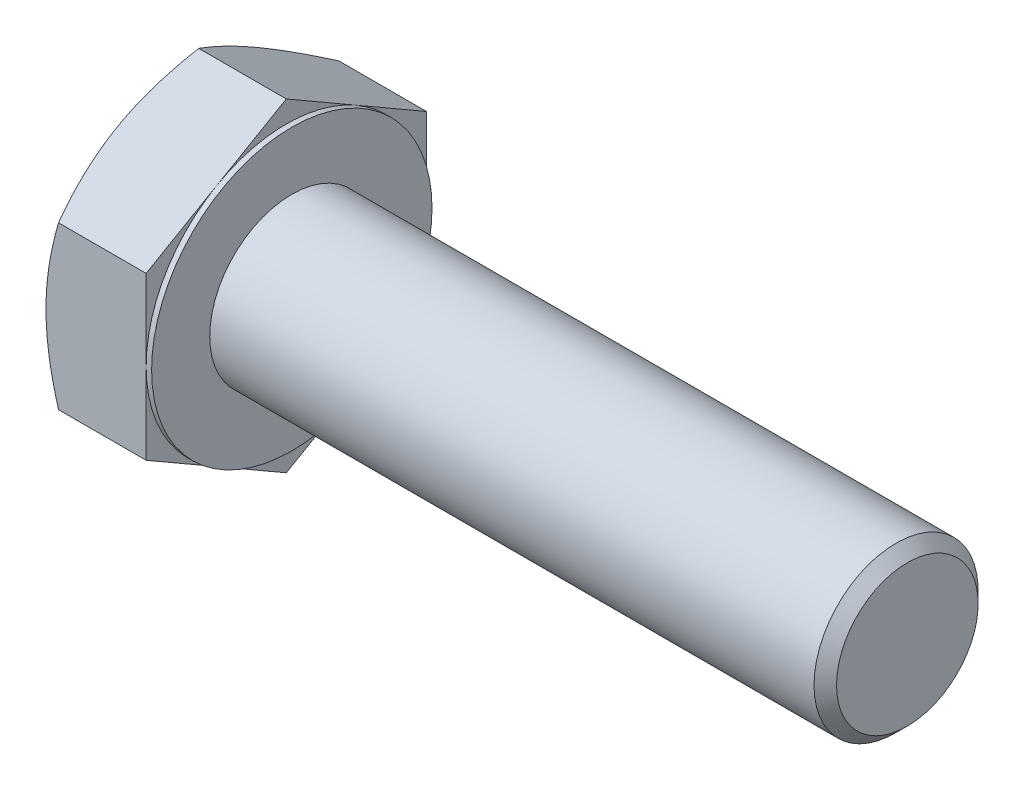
ISO-10303-21;
HEADER;
FILE_DESCRIPTION(('STEP AP214'),'2;1');
FILE_NAME('part.step','',(''),(''),'','','');
FILE_SCHEMA(('AUTOMOTIVE_DESIGN { 1 0 10303 214 1 1 1 1 }'));
ENDSEC;
DATA;
#1=APPLICATION_CONTEXT('core data for automotive mechanical design processes');
#2=APPLICATION_PROTOCOL_DEFINITION('international standard','automotive_design',2000,#1);
#3=PRODUCT_CONTEXT('',#1,'mechanical');
#4=PRODUCT('Part','Part','',(#3));
#5=PRODUCT_RELATED_PRODUCT_CATEGORY('part','',(#4));
#6=PRODUCT_DEFINITION_FORMATION('','',#4);
#7=PRODUCT_DEFINITION_CONTEXT('part definition',#1,'design');
#8=PRODUCT_DEFINITION('design','',#6,#7);
#9=PRODUCT_DEFINITION_SHAPE('','',#8);
#10=(LENGTH_UNIT() NAMED_UNIT(*) SI_UNIT(.MILLI.,.METRE.));
#11=(NAMED_UNIT(*) PLANE_ANGLE_UNIT() SI_UNIT($,.RADIAN.));
#12=(NAMED_UNIT(*) SI_UNIT($,.STERADIAN.) SOLID_ANGLE_UNIT());
#13=UNCERTAINTY_MEASURE_WITH_UNIT(LENGTH_MEASURE(1.E-05),#10,'distance_accuracy_value','');
#14=(GEOMETRIC_REPRESENTATION_CONTEXT(3) GLOBAL_UNCERTAINTY_ASSIGNED_CONTEXT((#13)) GLOBAL_UNIT_ASSIGNED_CONTEXT((#10,
#11,#12)) REPRESENTATION_CONTEXT('',''));
#15=CARTESIAN_POINT('',(0.,0.,0.));
#16=DIRECTION('',(0.,0.,1.));
#17=DIRECTION('',(1.,0.,0.));
#18=AXIS2_PLACEMENT_3D('',#15,#16,#17);
#19=CARTESIAN_POINT('',(15.44,23.6713610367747,0.));
#20=DIRECTION('',(1.,0.,0.));
#21=DIRECTION('',(0.,0.,-1.));
#22=AXIS2_PLACEMENT_3D('',#19,#20,#21);
#23=PLANE('',#22);
#24=CARTESIAN_POINT('',(15.44,0.,0.));
#25=DIRECTION('',(1.,0.,0.));
#26=DIRECTION('',(0.,0.,-1.));
#27=AXIS2_PLACEMENT_3D('',#24,#25,#26);
#28=CIRCLE('',#27,12.);
#29=CARTESIAN_POINT('',(15.44,0.,-12.));
#30=VERTEX_POINT('',#29);
#31=EDGE_CURVE('E277',#30,#30,#28,.F.);
#32=ORIENTED_EDGE('',*,*,#31,.T.);
#33=EDGE_LOOP('',(#32));
#34=FACE_BOUND('',#33,.T.);
#35=CARTESIAN_POINT('',(15.44,0.,0.));
#36=DIRECTION('',(1.,0.,0.));
#37=DIRECTION('',(0.,0.,-1.));
#38=AXIS2_PLACEMENT_3D('',#35,#36,#37);
#39=CIRCLE('',#38,20.5);
#40=CARTESIAN_POINT('',(15.44,0.,-20.5));
#41=VERTEX_POINT('',#40);
#42=EDGE_CURVE('E296',#41,#41,#39,.T.);
#43=ORIENTED_EDGE('',*,*,#42,.T.);
#44=EDGE_LOOP('',(#43));
#45=FACE_BOUND('',#44,.T.);
#46=ADVANCED_FACE('F33',(#34,#45),#23,.T.);
#47=CARTESIAN_POINT('',(0.,0.,0.));
#48=DIRECTION('',(-1.,0.,0.));
#49=DIRECTION('',(0.,0.,1.));
#50=AXIS2_PLACEMENT_3D('',#47,#48,#49);
#51=CYLINDRICAL_SURFACE('',#50,12.);
#52=ORIENTED_EDGE('',*,*,#31,.F.);
#53=EDGE_LOOP('',(#52));
#54=FACE_BOUND('',#53,.T.);
#55=CARTESIAN_POINT('',(103.792,0.,0.));
#56=DIRECTION('',(-1.,0.,0.));
#57=DIRECTION('',(0.,0.,1.));
#58=AXIS2_PLACEMENT_3D('',#55,#56,#57);
#59=CIRCLE('',#58,12.);
#60=CARTESIAN_POINT('',(103.792,0.,12.));
#61=VERTEX_POINT('',#60);
#62=EDGE_CURVE('E274',#61,#61,#59,.T.);
#63=ORIENTED_EDGE('',*,*,#62,.T.);
#64=EDGE_LOOP('',(#63));
#65=FACE_BOUND('',#64,.T.);
#66=ADVANCED_FACE('F248',(#54,#65),#51,.T.);
#67=CARTESIAN_POINT('',(105.44,0.,0.));
#68=DIRECTION('',(-1.,0.,0.));
#69=DIRECTION('',(0.,0.,1.));
#70=AXIS2_PLACEMENT_3D('',#67,#68,#69);
#71=CONICAL_SURFACE('',#70,10.352,0.785398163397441);
#72=ORIENTED_EDGE('',*,*,#62,.F.);
#73=EDGE_LOOP('',(#72));
#74=FACE_BOUND('',#73,.T.);
#75=CARTESIAN_POINT('',(105.44,0.,0.));
#76=DIRECTION('',(-1.,0.,0.));
#77=DIRECTION('',(0.,0.,1.));
#78=AXIS2_PLACEMENT_3D('',#75,#76,#77);
#79=CIRCLE('',#78,10.352);
#80=CARTESIAN_POINT('',(105.44,0.,10.352));
#81=VERTEX_POINT('',#80);
#82=EDGE_CURVE('E272',#81,#81,#79,.T.);
#83=ORIENTED_EDGE('',*,*,#82,.T.);
#84=EDGE_LOOP('',(#83));
#85=FACE_BOUND('',#84,.T.);
#86=ADVANCED_FACE('F253',(#74,#85),#71,.T.);
#87=CARTESIAN_POINT('',(105.44,0.,0.));
#88=DIRECTION('',(-1.,0.,0.));
#89=DIRECTION('',(0.,0.,1.));
#90=AXIS2_PLACEMENT_3D('',#87,#88,#89);
#91=PLANE('',#90);
#92=ORIENTED_EDGE('',*,*,#82,.F.);
#93=EDGE_LOOP('',(#92));
#94=FACE_BOUND('',#93,.T.);
#95=ADVANCED_FACE('F260',(#94),#91,.F.);
#96=CARTESIAN_POINT('',(14.64,20.5,0.));
#97=DIRECTION('',(1.,0.,0.));
#98=DIRECTION('',(0.,0.,-1.));
#99=AXIS2_PLACEMENT_3D('',#96,#97,#98);
#100=PLANE('',#99);
#101=DIRECTION('',(0.,0.500000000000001,0.866025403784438));
#102=VECTOR('',#101,1.);
#103=CARTESIAN_POINT('',(14.64,11.8356805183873,-20.5));
#104=LINE('',#103,#102);
#105=CARTESIAN_POINT('',(14.64,11.8356805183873,-20.5));
#106=VERTEX_POINT('',#105);
#107=CARTESIAN_POINT('',(14.64,17.753520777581,-10.25));
#108=VERTEX_POINT('',#107);
#109=EDGE_CURVE('E166',#106,#108,#104,.T.);
#110=ORIENTED_EDGE('',*,*,#109,.T.);
#111=CARTESIAN_POINT('',(14.64,0.,0.));
#112=DIRECTION('',(-1.,0.,0.));
#113=DIRECTION('',(0.,0.,1.));
#114=AXIS2_PLACEMENT_3D('',#111,#112,#113);
#115=CIRCLE('',#114,20.5);
#116=CARTESIAN_POINT('',(14.64,0.,-20.5));
#117=VERTEX_POINT('',#116);
#118=EDGE_CURVE('E49',#108,#117,#115,.T.);
#119=ORIENTED_EDGE('',*,*,#118,.T.);
#120=DIRECTION('',(0.,1.,0.));
#121=VECTOR('',#120,1.);
#122=CARTESIAN_POINT('',(14.64,11.8356805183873,-20.5));
#123=LINE('',#122,#121);
#124=EDGE_CURVE('E38',#117,#106,#123,.T.);
#125=ORIENTED_EDGE('',*,*,#124,.T.);
#126=EDGE_LOOP('',(#110,#119,#125));
#127=FACE_BOUND('',#126,.T.);
#128=ADVANCED_FACE('F263',(#127),#100,.T.);
#129=CARTESIAN_POINT('',(14.64,23.6713610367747,0.));
#130=VERTEX_POINT('',#129);
#131=EDGE_CURVE('E164',#108,#130,#104,.T.);
#132=ORIENTED_EDGE('',*,*,#131,.T.);
#133=DIRECTION('',(0.,-0.500000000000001,0.866025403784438));
#134=VECTOR('',#133,1.);
#135=CARTESIAN_POINT('',(14.64,23.6713610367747,0.));
#136=LINE('',#135,#134);
#137=CARTESIAN_POINT('',(14.64,17.753520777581,10.25));
#138=VERTEX_POINT('',#137);
#139=EDGE_CURVE('E163',#130,#138,#136,.T.);
#140=ORIENTED_EDGE('',*,*,#139,.T.);
#141=EDGE_CURVE('E152',#138,#108,#115,.T.);
#142=ORIENTED_EDGE('',*,*,#141,.T.);
#143=EDGE_LOOP('',(#132,#140,#142));
#144=FACE_BOUND('',#143,.T.);
#145=ADVANCED_FACE('F268',(#144),#100,.T.);
#146=CARTESIAN_POINT('',(14.64,11.8356805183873,20.5));
#147=VERTEX_POINT('',#146);
#148=EDGE_CURVE('E131',#138,#147,#136,.T.);
#149=ORIENTED_EDGE('',*,*,#148,.T.);
#150=DIRECTION('',(0.,-1.,0.));
#151=VECTOR('',#150,1.);
#152=CARTESIAN_POINT('',(14.64,11.8356805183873,20.5));
#153=LINE('',#152,#151);
#154=CARTESIAN_POINT('',(14.64,0.,20.5));
#155=VERTEX_POINT('',#154);
#156=EDGE_CURVE('E125',#147,#155,#153,.T.);
#157=ORIENTED_EDGE('',*,*,#156,.T.);
#158=EDGE_CURVE('E129',#155,#138,#115,.T.);
#159=ORIENTED_EDGE('',*,*,#158,.T.);
#160=EDGE_LOOP('',(#149,#157,#159));
#161=FACE_BOUND('',#160,.T.);
#162=ADVANCED_FACE('F127',(#161),#100,.T.);
#163=CARTESIAN_POINT('',(14.64,-11.8356805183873,20.5));
#164=VERTEX_POINT('',#163);
#165=EDGE_CURVE('E135',#155,#164,#153,.T.);
#166=ORIENTED_EDGE('',*,*,#165,.T.);
#167=DIRECTION('',(0.,-0.500000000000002,-0.866025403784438));
#168=VECTOR('',#167,1.);
#169=CARTESIAN_POINT('',(14.64,-23.6713610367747,0.));
#170=LINE('',#169,#168);
#171=CARTESIAN_POINT('',(14.64,-17.753520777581,10.25));
#172=VERTEX_POINT('',#171);
#173=EDGE_CURVE('E142',#164,#172,#170,.T.);
#174=ORIENTED_EDGE('',*,*,#173,.T.);
#175=EDGE_CURVE('E139',#172,#155,#115,.T.);
#176=ORIENTED_EDGE('',*,*,#175,.T.);
#177=EDGE_LOOP('',(#166,#174,#176));
#178=FACE_BOUND('',#177,.T.);
#179=ADVANCED_FACE('F140',(#178),#100,.T.);
#180=CARTESIAN_POINT('',(14.64,-23.6713610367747,0.));
#181=VERTEX_POINT('',#180);
#182=EDGE_CURVE('E158',#172,#181,#170,.T.);
#183=ORIENTED_EDGE('',*,*,#182,.T.);
#184=DIRECTION('',(0.,0.5,-0.866025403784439));
#185=VECTOR('',#184,1.);
#186=CARTESIAN_POINT('',(14.64,-11.8356805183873,-20.5));
#187=LINE('',#186,#185);
#188=CARTESIAN_POINT('',(14.64,-17.753520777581,-10.25));
#189=VERTEX_POINT('',#188);
#190=EDGE_CURVE('E332',#181,#189,#187,.T.);
#191=ORIENTED_EDGE('',*,*,#190,.T.);
#192=EDGE_CURVE('E146',#189,#172,#115,.T.);
#193=ORIENTED_EDGE('',*,*,#192,.T.);
#194=EDGE_LOOP('',(#183,#191,#193));
#195=FACE_BOUND('',#194,.T.);
#196=ADVANCED_FACE('F337',(#195),#100,.T.);
#197=CARTESIAN_POINT('',(14.64,-11.8356805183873,-20.5));
#198=VERTEX_POINT('',#197);
#199=EDGE_CURVE('E153',#189,#198,#187,.T.);
#200=ORIENTED_EDGE('',*,*,#199,.T.);
#201=EDGE_CURVE('E11',#198,#117,#123,.T.);
#202=ORIENTED_EDGE('',*,*,#201,.T.);
#203=EDGE_CURVE('E350',#117,#189,#115,.T.);
#204=ORIENTED_EDGE('',*,*,#203,.T.);
#205=EDGE_LOOP('',(#200,#202,#204));
#206=FACE_BOUND('',#205,.T.);
#207=ADVANCED_FACE('F269',(#206),#100,.T.);
#208=CARTESIAN_POINT('',(0.,0.,0.));
#209=DIRECTION('',(-1.,0.,0.));
#210=DIRECTION('',(0.,0.,1.));
#211=AXIS2_PLACEMENT_3D('',#208,#209,#210);
#212=CYLINDRICAL_SURFACE('',#211,20.5);
#213=ORIENTED_EDGE('',*,*,#118,.F.);
#214=ORIENTED_EDGE('',*,*,#141,.F.);
#215=ORIENTED_EDGE('',*,*,#158,.F.);
#216=ORIENTED_EDGE('',*,*,#175,.F.);
#217=ORIENTED_EDGE('',*,*,#192,.F.);
#218=ORIENTED_EDGE('',*,*,#203,.F.);
#219=EDGE_LOOP('',(#213,#214,#215,#216,#217,#218));
#220=FACE_BOUND('',#219,.T.);
#221=ORIENTED_EDGE('',*,*,#42,.F.);
#222=EDGE_LOOP('',(#221));
#223=FACE_BOUND('',#222,.T.);
#224=ADVANCED_FACE('F149',(#220,#223),#212,.T.);
#225=CARTESIAN_POINT('',(0.,23.6713610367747,0.));
#226=DIRECTION('',(1.,0.,0.));
#227=DIRECTION('',(0.,0.,-1.));
#228=AXIS2_PLACEMENT_3D('',#225,#226,#227);
#229=PLANE('',#228);
#230=CARTESIAN_POINT('',(0.,0.,0.));
#231=DIRECTION('',(1.,0.,0.));
#232=DIRECTION('',(0.,0.,-1.));
#233=AXIS2_PLACEMENT_3D('',#230,#231,#232);
#234=CIRCLE('',#233,20.5);
#235=CARTESIAN_POINT('',(0.,0.,-20.5));
#236=VERTEX_POINT('',#235);
#237=CARTESIAN_POINT('',(0.,17.753520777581,-10.25));
#238=VERTEX_POINT('',#237);
#239=EDGE_CURVE('E295',#236,#238,#234,.T.);
#240=ORIENTED_EDGE('',*,*,#239,.F.);
#241=CARTESIAN_POINT('',(0.,-17.753520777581,-10.25));
#242=VERTEX_POINT('',#241);
#243=EDGE_CURVE('E292',#242,#236,#234,.T.);
#244=ORIENTED_EDGE('',*,*,#243,.F.);
#245=CARTESIAN_POINT('',(0.,-17.753520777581,10.25));
#246=VERTEX_POINT('',#245);
#247=EDGE_CURVE('E294',#246,#242,#234,.T.);
#248=ORIENTED_EDGE('',*,*,#247,.F.);
#249=CARTESIAN_POINT('',(0.,0.,20.5));
#250=VERTEX_POINT('',#249);
#251=EDGE_CURVE('E304',#250,#246,#234,.T.);
#252=ORIENTED_EDGE('',*,*,#251,.F.);
#253=CARTESIAN_POINT('',(0.,0.,0.));
#254=DIRECTION('',(-1.,0.,0.));
#255=DIRECTION('',(0.,0.,1.));
#256=AXIS2_PLACEMENT_3D('',#253,#254,#255);
#257=CIRCLE('',#256,20.5);
#258=CARTESIAN_POINT('',(0.,17.753520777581,10.25));
#259=VERTEX_POINT('',#258);
#260=EDGE_CURVE('E167',#250,#259,#257,.T.);
#261=ORIENTED_EDGE('',*,*,#260,.T.);
#262=EDGE_CURVE('E299',#238,#259,#234,.T.);
#263=ORIENTED_EDGE('',*,*,#262,.F.);
#264=EDGE_LOOP('',(#240,#244,#248,#252,#261,#263));
#265=FACE_BOUND('',#264,.T.);
#266=ADVANCED_FACE('F198',(#265),#229,.F.);
#267=CARTESIAN_POINT('',(0.,0.,0.));
#268=DIRECTION('',(1.,0.,0.));
#269=DIRECTION('',(0.,0.,-1.));
#270=AXIS2_PLACEMENT_3D('',#267,#268,#269);
#271=CONICAL_SURFACE('',#270,20.5,1.0471975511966);
#272=CARTESIAN_POINT('',(1.83105281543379,11.8355650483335,20.5002));
#273=CARTESIAN_POINT('',(1.68086967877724,12.0957082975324,20.0496186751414));
#274=CARTESIAN_POINT('',(1.5375016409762,12.3568662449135,19.5972798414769));
#275=CARTESIAN_POINT('',(1.26629011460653,12.8812763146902,18.688974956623));
#276=CARTESIAN_POINT('',(1.13845173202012,13.1445290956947,18.2330077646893));
#277=CARTESIAN_POINT('',(0.900017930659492,13.6736376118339,17.3165649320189));
#278=CARTESIAN_POINT('',(0.789463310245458,13.9394979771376,16.8560812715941));
#279=CARTESIAN_POINT('',(0.587971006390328,14.4730660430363,15.9319142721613));
#280=CARTESIAN_POINT('',(0.497032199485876,14.7407736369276,15.4682311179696));
#281=CARTESIAN_POINT('',(0.338639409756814,15.2711766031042,14.5495462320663));
#282=CARTESIAN_POINT('',(0.270661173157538,15.5338325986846,14.0946127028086));
#283=CARTESIAN_POINT('',(0.15667706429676,16.0603481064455,13.1826610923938));
#284=CARTESIAN_POINT('',(0.110671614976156,16.3242076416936,12.7256429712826));
#285=CARTESIAN_POINT('',(0.0417946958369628,16.8523699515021,11.8108390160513));
#286=CARTESIAN_POINT('',(0.0188957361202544,17.1166718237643,11.3530547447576));
#287=CARTESIAN_POINT('',(-0.0032757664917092,17.6455194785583,10.4370637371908));
#288=CARTESIAN_POINT('',(-0.00254903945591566,17.9100652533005,9.97885701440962));
#289=CARTESIAN_POINT('',(0.0208807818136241,18.4046387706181,9.1222305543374));
#290=CARTESIAN_POINT('',(0.0407268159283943,18.6347017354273,8.72374981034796));
#291=CARTESIAN_POINT('',(0.0979103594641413,19.094278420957,7.92773964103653));
#292=CARTESIAN_POINT('',(0.135247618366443,19.3237921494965,7.5302102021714));
#293=CARTESIAN_POINT('',(0.22676651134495,19.7821855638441,6.73624951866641));
#294=CARTESIAN_POINT('',(0.280963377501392,20.0110644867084,6.33981959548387));
#295=CARTESIAN_POINT('',(0.405242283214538,20.4677264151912,5.54885793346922));
#296=CARTESIAN_POINT('',(0.475324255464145,20.6955094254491,5.15432618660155));
#297=CARTESIAN_POINT('',(0.711196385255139,21.387010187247,3.95661173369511));
#298=CARTESIAN_POINT('',(0.900518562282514,21.8487632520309,3.15683196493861));
#299=CARTESIAN_POINT('',(1.22283076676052,22.5362934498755,1.96599473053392));
#300=CARTESIAN_POINT('',(1.3365403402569,22.7644232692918,1.57086229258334));
#301=CARTESIAN_POINT('',(1.57547119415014,23.2191049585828,0.783330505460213));
#302=CARTESIAN_POINT('',(1.70068922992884,23.4456572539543,0.390930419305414));
#303=CARTESIAN_POINT('',(1.83105281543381,23.6714765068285,-0.000199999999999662));
#304=B_SPLINE_CURVE_WITH_KNOTS('',3,(#272,#273,#274,#275,#276,#277,#278,#279,#280,#281,#282,
#283,#284,#285,#286,#287,#288,#289,#290,#291,#292,#293,#294,#295,#296,#297,#298,#299,#300,#301,
#302,#303),.UNSPECIFIED.,.F.,.F.,(4,2,2,2,2,2,2,2,2,2,2,2,2,2,2,4),(0.,1.62462772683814,
3.24978817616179,4.87872871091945,6.50757592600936,8.09621981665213,9.68489428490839,
11.2716764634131,12.8584096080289,14.2397371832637,15.6210449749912,17.0036043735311,
18.3861579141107,21.2121645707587,22.6227063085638,24.0328515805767),.UNSPECIFIED.);
#305=CARTESIAN_POINT('',(1.83098614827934,23.6713610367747,0.));
#306=VERTEX_POINT('',#305);
#307=EDGE_CURVE('E217',#259,#306,#304,.T.);
#308=ORIENTED_EDGE('',*,*,#307,.T.);
#309=CARTESIAN_POINT('',(1.83105281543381,23.6714765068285,0.000200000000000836));
#310=CARTESIAN_POINT('',(1.68086967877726,23.4113332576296,-0.45038132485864));
#311=CARTESIAN_POINT('',(1.53750164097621,23.1501753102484,-0.902720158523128));
#312=CARTESIAN_POINT('',(1.26629011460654,22.6257652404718,-1.81102504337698));
#313=CARTESIAN_POINT('',(1.13845173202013,22.3625124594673,-2.26699223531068));
#314=CARTESIAN_POINT('',(0.900017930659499,21.8334039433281,-3.1834350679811));
#315=CARTESIAN_POINT('',(0.789463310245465,21.5675435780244,-3.64391872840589));
#316=CARTESIAN_POINT('',(0.587971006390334,21.0339755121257,-4.56808572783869));
#317=CARTESIAN_POINT('',(0.497032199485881,20.7662679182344,-5.0317688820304));
#318=CARTESIAN_POINT('',(0.338639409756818,20.2358649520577,-5.95045376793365));
#319=CARTESIAN_POINT('',(0.270661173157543,19.9732089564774,-6.40538729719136));
#320=CARTESIAN_POINT('',(0.156677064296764,19.4466934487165,-7.3173389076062));
#321=CARTESIAN_POINT('',(0.110671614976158,19.1828339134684,-7.77435702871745));
#322=CARTESIAN_POINT('',(0.0417946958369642,18.6546716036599,-8.68916098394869));
#323=CARTESIAN_POINT('',(0.0188957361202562,18.3903697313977,-9.14694525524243));
#324=CARTESIAN_POINT('',(-0.0032757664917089,17.8615220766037,-10.0629362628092));
#325=CARTESIAN_POINT('',(-0.00254903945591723,17.5969763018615,-10.5211429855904));
#326=CARTESIAN_POINT('',(0.0208807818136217,17.1024027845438,-11.3777694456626));
#327=CARTESIAN_POINT('',(0.0407268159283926,16.8723398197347,-11.776250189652));
#328=CARTESIAN_POINT('',(0.0979103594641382,16.412763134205,-12.5722603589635));
#329=CARTESIAN_POINT('',(0.135247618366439,16.1832494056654,-12.9697897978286));
#330=CARTESIAN_POINT('',(0.226766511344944,15.7248559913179,-13.7637504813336));
#331=CARTESIAN_POINT('',(0.280963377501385,15.4959770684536,-14.1601804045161));
#332=CARTESIAN_POINT('',(0.40524228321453,15.0393151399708,-14.9511420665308));
#333=CARTESIAN_POINT('',(0.475324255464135,14.8115321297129,-15.3456738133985));
#334=CARTESIAN_POINT('',(0.711196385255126,14.120031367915,-16.5433882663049));
#335=CARTESIAN_POINT('',(0.900518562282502,13.658278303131,-17.3431680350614));
#336=CARTESIAN_POINT('',(1.22283076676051,12.9707481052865,-18.5340052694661));
#337=CARTESIAN_POINT('',(1.33654034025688,12.7426182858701,-18.9291377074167));
#338=CARTESIAN_POINT('',(1.57547119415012,12.2879365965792,-19.7166694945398));
#339=CARTESIAN_POINT('',(1.70068922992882,12.0613843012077,-20.1090695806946));
#340=CARTESIAN_POINT('',(1.83105281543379,11.8355650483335,-20.5002));
#341=B_SPLINE_CURVE_WITH_KNOTS('',3,(#309,#310,#311,#312,#313,#314,#315,#316,#317,#318,#319,
#320,#321,#322,#323,#324,#325,#326,#327,#328,#329,#330,#331,#332,#333,#334,#335,#336,#337,#338,
#339,#340),.UNSPECIFIED.,.F.,.F.,(4,2,2,2,2,2,2,2,2,2,2,2,2,2,2,4),(0.,1.62462772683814,
3.24978817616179,4.87872871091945,6.50757592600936,8.09621981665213,9.6848942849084,
11.2716764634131,12.8584096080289,14.2397371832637,15.6210449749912,17.0036043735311,
18.3861579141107,21.2121645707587,22.6227063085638,24.0328515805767),.UNSPECIFIED.);
#342=EDGE_CURVE('E57',#306,#238,#341,.T.);
#343=ORIENTED_EDGE('',*,*,#342,.T.);
#344=ORIENTED_EDGE('',*,*,#262,.T.);
#345=EDGE_LOOP('',(#308,#343,#344));
#346=FACE_BOUND('',#345,.T.);
#347=ADVANCED_FACE('F346',(#346),#271,.T.);
#348=CARTESIAN_POINT('',(10.0045735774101,-31.7921389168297,20.5));
#349=CARTESIAN_POINT('',(9.78736329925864,-31.3444790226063,20.5));
#350=CARTESIAN_POINT('',(9.57123614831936,-30.896293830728,20.5));
#351=CARTESIAN_POINT('',(9.14139340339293,-29.9987632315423,20.5));
#352=CARTESIAN_POINT('',(8.92767783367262,-29.5494178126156,20.5));
#353=CARTESIAN_POINT('',(8.29046013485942,-28.1993571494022,20.5));
#354=CARTESIAN_POINT('',(7.87095143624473,-27.2967499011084,20.5));
#355=CARTESIAN_POINT('',(7.04286118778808,-25.480583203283,20.5));
#356=CARTESIAN_POINT('',(6.63435156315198,-24.5669908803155,20.5));
#357=CARTESIAN_POINT('',(5.83404260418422,-22.7325410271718,20.5));
#358=CARTESIAN_POINT('',(5.44224248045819,-21.8116838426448,20.5));
#359=CARTESIAN_POINT('',(4.66751070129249,-19.9314771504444,20.5));
#360=CARTESIAN_POINT('',(4.28526901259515,-18.9718418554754,20.5));
#361=CARTESIAN_POINT('',(3.54971359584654,-17.0413372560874,20.5));
#362=CARTESIAN_POINT('',(3.19640311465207,-16.070466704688,20.5));
#363=CARTESIAN_POINT('',(2.52799067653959,-14.1177960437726,20.5));
#364=CARTESIAN_POINT('',(2.2128113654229,-13.1360226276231,20.5));
#365=CARTESIAN_POINT('',(1.63075735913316,-11.1582993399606,20.5));
#366=CARTESIAN_POINT('',(1.36386744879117,-10.1623540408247,20.5));
#367=CARTESIAN_POINT('',(1.01013936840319,-8.66039751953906,20.5));
#368=CARTESIAN_POINT('',(0.900235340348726,-8.15978559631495,20.5));
#369=CARTESIAN_POINT('',(0.697271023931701,-7.15514108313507,20.5));
#370=CARTESIAN_POINT('',(0.604210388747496,-6.65110856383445,20.5));
#371=CARTESIAN_POINT('',(0.436577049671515,-5.63997954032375,20.5));
#372=CARTESIAN_POINT('',(0.362003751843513,-5.13288313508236,20.5));
#373=CARTESIAN_POINT('',(0.23282804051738,-4.11613536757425,20.5));
#374=CARTESIAN_POINT('',(0.178225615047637,-3.60648400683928,20.5));
#375=CARTESIAN_POINT('',(0.090765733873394,-2.59202077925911,20.5));
#376=CARTESIAN_POINT('',(0.0576332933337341,-2.08723276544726,20.5));
#377=CARTESIAN_POINT('',(0.0127447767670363,-1.07670899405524,20.5));
#378=CARTESIAN_POINT('',(0.000988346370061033,-0.570973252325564,20.5));
#379=CARTESIAN_POINT('',(-0.000868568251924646,0.440543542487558,20.5));
#380=CARTESIAN_POINT('',(0.00903105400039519,0.946324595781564,20.5));
#381=CARTESIAN_POINT('',(0.0502449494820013,1.95701882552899,20.5));
#382=CARTESIAN_POINT('',(0.0815601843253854,2.46193196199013,20.5));
#383=CARTESIAN_POINT('',(0.18189293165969,3.67541240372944,20.5));
#384=CARTESIAN_POINT('',(0.261072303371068,4.38315427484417,20.5));
#385=CARTESIAN_POINT('',(0.457195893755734,5.79338947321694,20.5));
#386=CARTESIAN_POINT('',(0.574145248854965,6.49588207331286,20.5));
#387=CARTESIAN_POINT('',(0.841648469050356,7.89494840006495,20.5));
#388=CARTESIAN_POINT('',(0.992228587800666,8.59151705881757,20.5));
#389=CARTESIAN_POINT('',(1.32239799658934,9.97766865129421,20.5));
#390=CARTESIAN_POINT('',(1.50198684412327,10.6672516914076,20.5));
#391=CARTESIAN_POINT('',(1.89003635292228,12.0545545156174,20.5));
#392=CARTESIAN_POINT('',(2.09904485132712,12.7521199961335,20.5));
#393=CARTESIAN_POINT('',(2.538641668,14.1403793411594,20.5));
#394=CARTESIAN_POINT('',(2.76923012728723,14.8310731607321,20.5));
#395=CARTESIAN_POINT('',(3.2483270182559,16.2059303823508,20.5));
#396=CARTESIAN_POINT('',(3.49682946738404,16.8900958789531,20.5));
#397=CARTESIAN_POINT('',(4.00883234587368,18.2527591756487,20.5));
#398=CARTESIAN_POINT('',(4.27233260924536,18.9312570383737,20.5));
#399=CARTESIAN_POINT('',(4.90504075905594,20.5167699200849,20.5));
#400=CARTESIAN_POINT('',(5.27932054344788,21.421757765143,20.5));
#401=CARTESIAN_POINT('',(6.04577825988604,23.224144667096,20.5));
#402=CARTESIAN_POINT('',(6.43795725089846,24.1215432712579,20.5));
#403=CARTESIAN_POINT('',(7.23667478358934,25.9101426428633,20.5));
#404=CARTESIAN_POINT('',(7.64321640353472,26.8013420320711,20.5));
#405=CARTESIAN_POINT('',(8.46779917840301,28.5783696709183,20.5));
#406=CARTESIAN_POINT('',(8.88584009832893,29.4641980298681,20.5));
#407=CARTESIAN_POINT('',(9.73174717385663,31.2323047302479,20.5));
#408=CARTESIAN_POINT('',(10.1596233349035,32.1145782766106,20.5));
#409=CARTESIAN_POINT('',(11.023106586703,33.8753332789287,20.5));
#410=CARTESIAN_POINT('',(11.4587137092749,34.7538147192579,20.5));
#411=CARTESIAN_POINT('',(12.336294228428,36.5074549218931,20.5));
#412=CARTESIAN_POINT('',(12.7782668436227,37.3826140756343,20.5));
#413=CARTESIAN_POINT('',(13.6675972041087,39.1301871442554,20.5));
#414=CARTESIAN_POINT('',(14.1149549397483,40.002601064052,20.5));
#415=CARTESIAN_POINT('',(15.3896420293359,42.4725798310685,20.5));
#416=CARTESIAN_POINT('',(16.2223378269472,44.0673751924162,20.5));
#417=CARTESIAN_POINT('',(17.8991647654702,47.2509978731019,20.5));
#418=CARTESIAN_POINT('',(18.7432962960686,48.8398249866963,20.5));
#419=CARTESIAN_POINT('',(20.4382614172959,52.0089141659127,20.5));
#420=CARTESIAN_POINT('',(21.2890736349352,53.589187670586,20.5));
#421=CARTESIAN_POINT('',(22.5704014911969,55.9567745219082,20.5));
#422=CARTESIAN_POINT('',(22.9983509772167,56.7454787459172,20.5));
#423=CARTESIAN_POINT('',(23.8557834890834,58.3220516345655,20.5));
#424=CARTESIAN_POINT('',(24.2852665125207,59.1099203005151,20.5));
#425=CARTESIAN_POINT('',(24.7154284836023,59.8974182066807,20.5));
#426=B_SPLINE_CURVE_WITH_KNOTS('',3,(#348,#349,#350,#351,#352,#353,#354,#355,#356,#357,#358,
#359,#360,#361,#362,#363,#364,#365,#366,#367,#368,#369,#370,#371,#372,#373,#374,#375,#376,#377,
#378,#379,#380,#381,#382,#383,#384,#385,#386,#387,#388,#389,#390,#391,#392,#393,#394,#395,#396,
#397,#398,#399,#400,#401,#402,#403,#404,#405,#406,#407,#408,#409,#410,#411,#412,#413,#414,#415,
#416,#417,#418,#419,#420,#421,#422,#423,#424,#425),.UNSPECIFIED.,.F.,.F.,(4,2,2,2,2,2,2,2,2,2,2,
2,2,2,2,2,2,2,2,2,2,2,2,2,2,2,2,2,2,2,2,2,2,2,2,2,2,2,4),(0.,1.49271869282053,2.9854523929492,
5.97136149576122,8.9735268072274,11.9755501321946,15.0740772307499,18.1729515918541,
21.2654301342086,24.3569325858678,25.8942973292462,27.4316304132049,28.9689141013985,
30.5061968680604,32.0233793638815,33.5405367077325,35.0577015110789,36.5749344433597,
38.7102245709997,40.8458052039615,42.9830588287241,45.1202798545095,47.3044767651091,
49.4886879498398,51.6721730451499,53.8556339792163,56.7933660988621,59.7312722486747,
62.6698119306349,65.6082916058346,68.5499059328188,71.4915323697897,74.4328007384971,
77.3740638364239,82.771288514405,88.168697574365,93.5529397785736,96.2449184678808,
98.9368929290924),.UNSPECIFIED.);
#427=CARTESIAN_POINT('',(1.83098614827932,11.8356805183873,20.5));
#428=VERTEX_POINT('',#427);
#429=EDGE_CURVE('E231',#250,#428,#426,.T.);
#430=ORIENTED_EDGE('',*,*,#429,.T.);
#431=EDGE_CURVE('E230',#428,#259,#304,.T.);
#432=ORIENTED_EDGE('',*,*,#431,.T.);
#433=ORIENTED_EDGE('',*,*,#260,.F.);
#434=EDGE_LOOP('',(#430,#432,#433));
#435=FACE_BOUND('',#434,.T.);
#436=ADVANCED_FACE('F342',(#435),#271,.T.);
#437=CARTESIAN_POINT('',(1.83098614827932,-11.8356805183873,20.5));
#438=VERTEX_POINT('',#437);
#439=EDGE_CURVE('E275',#438,#250,#426,.T.);
#440=ORIENTED_EDGE('',*,*,#439,.T.);
#441=ORIENTED_EDGE('',*,*,#251,.T.);
#442=CARTESIAN_POINT('',(1.83105281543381,-23.6714765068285,-0.000200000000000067));
#443=CARTESIAN_POINT('',(1.68086967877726,-23.4113332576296,0.450381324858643));
#444=CARTESIAN_POINT('',(1.53750164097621,-23.1501753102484,0.90272015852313));
#445=CARTESIAN_POINT('',(1.26629011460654,-22.6257652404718,1.81102504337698));
#446=CARTESIAN_POINT('',(1.13845173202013,-22.3625124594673,2.26699223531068));
#447=CARTESIAN_POINT('',(0.900017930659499,-21.8334039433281,3.1834350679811));
#448=CARTESIAN_POINT('',(0.789463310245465,-21.5675435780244,3.64391872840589));
#449=CARTESIAN_POINT('',(0.587971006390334,-21.0339755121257,4.5680857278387));
#450=CARTESIAN_POINT('',(0.497032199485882,-20.7662679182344,5.03176888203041));
#451=CARTESIAN_POINT('',(0.338639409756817,-20.2358649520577,5.95045376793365));
#452=CARTESIAN_POINT('',(0.270661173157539,-19.9732089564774,6.40538729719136));
#453=CARTESIAN_POINT('',(0.15667706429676,-19.4466934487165,7.3173389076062));
#454=CARTESIAN_POINT('',(0.110671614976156,-19.1828339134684,7.77435702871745));
#455=CARTESIAN_POINT('',(0.0417946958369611,-18.6546716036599,8.68916098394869));
#456=CARTESIAN_POINT('',(0.0188957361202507,-18.3903697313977,9.14694525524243));
#457=CARTESIAN_POINT('',(-0.00327576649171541,-17.8615220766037,10.0629362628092));
#458=CARTESIAN_POINT('',(-0.00254903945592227,-17.5969763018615,10.5211429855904));
#459=CARTESIAN_POINT('',(0.0208807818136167,-17.1024027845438,11.3777694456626));
#460=CARTESIAN_POINT('',(0.0407268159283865,-16.8723398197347,11.776250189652));
#461=CARTESIAN_POINT('',(0.0979103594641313,-16.412763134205,12.5722603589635));
#462=CARTESIAN_POINT('',(0.135247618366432,-16.1832494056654,12.9697897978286));
#463=CARTESIAN_POINT('',(0.226766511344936,-15.7248559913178,13.7637504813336));
#464=CARTESIAN_POINT('',(0.280963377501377,-15.4959770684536,14.1601804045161));
#465=CARTESIAN_POINT('',(0.405242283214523,-15.0393151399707,14.9511420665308));
#466=CARTESIAN_POINT('',(0.47532425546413,-14.8115321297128,15.3456738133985));
#467=CARTESIAN_POINT('',(0.711196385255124,-14.120031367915,16.5433882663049));
#468=CARTESIAN_POINT('',(0.900518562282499,-13.658278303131,17.3431680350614));
#469=CARTESIAN_POINT('',(1.2228307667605,-12.9707481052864,18.5340052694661));
#470=CARTESIAN_POINT('',(1.33654034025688,-12.7426182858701,18.9291377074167));
#471=CARTESIAN_POINT('',(1.57547119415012,-12.2879365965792,19.7166694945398));
#472=CARTESIAN_POINT('',(1.70068922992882,-12.0613843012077,20.1090695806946));
#473=CARTESIAN_POINT('',(1.83105281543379,-11.8355650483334,20.5002));
#474=B_SPLINE_CURVE_WITH_KNOTS('',3,(#442,#443,#444,#445,#446,#447,#448,#449,#450,#451,#452,
#453,#454,#455,#456,#457,#458,#459,#460,#461,#462,#463,#464,#465,#466,#467,#468,#469,#470,#471,
#472,#473),.UNSPECIFIED.,.F.,.F.,(4,2,2,2,2,2,2,2,2,2,2,2,2,2,2,4),(0.,1.62462772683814,
3.24978817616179,4.87872871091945,6.50757592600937,8.09621981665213,9.6848942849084,
11.2716764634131,12.8584096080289,14.2397371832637,15.6210449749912,17.0036043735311,
18.3861579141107,21.2121645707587,22.6227063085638,24.0328515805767),.UNSPECIFIED.);
#475=EDGE_CURVE('E219',#246,#438,#474,.T.);
#476=ORIENTED_EDGE('',*,*,#475,.T.);
#477=EDGE_LOOP('',(#440,#441,#476));
#478=FACE_BOUND('',#477,.T.);
#479=ADVANCED_FACE('F187',(#478),#271,.T.);
#480=CARTESIAN_POINT('',(1.83098614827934,-23.6713610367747,0.));
#481=VERTEX_POINT('',#480);
#482=EDGE_CURVE('E211',#481,#246,#474,.T.);
#483=ORIENTED_EDGE('',*,*,#482,.T.);
#484=ORIENTED_EDGE('',*,*,#247,.T.);
#485=CARTESIAN_POINT('',(1.8310528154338,-11.8355650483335,-20.5002));
#486=CARTESIAN_POINT('',(1.68086967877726,-12.0957082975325,-20.0496186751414));
#487=CARTESIAN_POINT('',(1.53750164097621,-12.3568662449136,-19.5972798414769));
#488=CARTESIAN_POINT('',(1.26629011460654,-12.8812763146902,-18.688974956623));
#489=CARTESIAN_POINT('',(1.13845173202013,-13.1445290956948,-18.2330077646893));
#490=CARTESIAN_POINT('',(0.900017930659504,-13.6736376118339,-17.3165649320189));
#491=CARTESIAN_POINT('',(0.789463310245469,-13.9394979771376,-16.8560812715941));
#492=CARTESIAN_POINT('',(0.587971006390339,-14.4730660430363,-15.9319142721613));
#493=CARTESIAN_POINT('',(0.497032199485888,-14.7407736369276,-15.4682311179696));
#494=CARTESIAN_POINT('',(0.338639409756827,-15.2711766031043,-14.5495462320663));
#495=CARTESIAN_POINT('',(0.270661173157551,-15.5338325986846,-14.0946127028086));
#496=CARTESIAN_POINT('',(0.156677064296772,-16.0603481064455,-13.1826610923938));
#497=CARTESIAN_POINT('',(0.110671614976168,-16.3242076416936,-12.7256429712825));
#498=CARTESIAN_POINT('',(0.041794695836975,-16.8523699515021,-11.8108390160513));
#499=CARTESIAN_POINT('',(0.0188957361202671,-17.1166718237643,-11.3530547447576));
#500=CARTESIAN_POINT('',(-0.0032757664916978,-17.6455194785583,-10.4370637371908));
#501=CARTESIAN_POINT('',(-0.00254903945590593,-17.9100652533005,-9.97885701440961));
#502=CARTESIAN_POINT('',(0.0208807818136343,-18.4046387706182,-9.12223055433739));
#503=CARTESIAN_POINT('',(0.0407268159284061,-18.6347017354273,-8.72374981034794));
#504=CARTESIAN_POINT('',(0.0979103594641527,-19.094278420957,-7.92773964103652));
#505=CARTESIAN_POINT('',(0.135247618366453,-19.3237921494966,-7.53021020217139));
#506=CARTESIAN_POINT('',(0.226766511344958,-19.7821855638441,-6.7362495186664));
#507=CARTESIAN_POINT('',(0.280963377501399,-20.0110644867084,-6.33981959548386));
#508=CARTESIAN_POINT('',(0.405242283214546,-20.4677264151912,-5.54885793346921));
#509=CARTESIAN_POINT('',(0.475324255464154,-20.6955094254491,-5.15432618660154));
#510=CARTESIAN_POINT('',(0.711196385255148,-21.387010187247,-3.95661173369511));
#511=CARTESIAN_POINT('',(0.900518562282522,-21.848763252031,-3.1568319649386));
#512=CARTESIAN_POINT('',(1.22283076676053,-22.5362934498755,-1.96599473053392));
#513=CARTESIAN_POINT('',(1.3365403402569,-22.7644232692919,-1.57086229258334));
#514=CARTESIAN_POINT('',(1.57547119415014,-23.2191049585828,-0.783330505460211));
#515=CARTESIAN_POINT('',(1.70068922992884,-23.4456572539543,-0.390930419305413));
#516=CARTESIAN_POINT('',(1.83105281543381,-23.6714765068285,0.000200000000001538));
#517=B_SPLINE_CURVE_WITH_KNOTS('',3,(#485,#486,#487,#488,#489,#490,#491,#492,#493,#494,#495,
#496,#497,#498,#499,#500,#501,#502,#503,#504,#505,#506,#507,#508,#509,#510,#511,#512,#513,#514,
#515,#516),.UNSPECIFIED.,.F.,.F.,(4,2,2,2,2,2,2,2,2,2,2,2,2,2,2,4),(0.,1.62462772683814,
3.24978817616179,4.87872871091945,6.50757592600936,8.09621981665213,9.68489428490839,
11.2716764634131,12.8584096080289,14.2397371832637,15.6210449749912,17.0036043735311,
18.3861579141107,21.2121645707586,22.6227063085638,24.0328515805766),.UNSPECIFIED.);
#518=EDGE_CURVE('E218',#242,#481,#517,.T.);
#519=ORIENTED_EDGE('',*,*,#518,.T.);
#520=EDGE_LOOP('',(#483,#484,#519));
#521=FACE_BOUND('',#520,.T.);
#522=ADVANCED_FACE('F313',(#521),#271,.T.);
#523=CARTESIAN_POINT('',(1.83098614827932,11.8356805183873,-20.5));
#524=VERTEX_POINT('',#523);
#525=EDGE_CURVE('E220',#238,#524,#341,.T.);
#526=ORIENTED_EDGE('',*,*,#525,.T.);
#527=CARTESIAN_POINT('',(10.0045735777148,-31.7921389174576,-20.5));
#528=CARTESIAN_POINT('',(9.78736329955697,-31.3444790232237,-20.5));
#529=CARTESIAN_POINT('',(9.57123614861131,-30.8962938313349,-20.5));
#530=CARTESIAN_POINT('',(9.14139340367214,-29.998763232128,-20.5));
#531=CARTESIAN_POINT('',(8.92767783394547,-29.5494178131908,-20.5));
#532=CARTESIAN_POINT('',(8.2904601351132,-28.1993571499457,-20.5));
#533=CARTESIAN_POINT('',(7.87095143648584,-27.2967499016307,-20.5));
#534=CARTESIAN_POINT('',(7.04286118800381,-25.4805832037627,-20.5));
#535=CARTESIAN_POINT('',(6.63435156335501,-24.5669908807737,-20.5));
#536=CARTESIAN_POINT('',(5.83404260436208,-22.7325410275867,-20.5));
#537=CARTESIAN_POINT('',(5.44224248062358,-21.8116838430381,-20.5));
#538=CARTESIAN_POINT('',(4.66751070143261,-19.9314771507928,-20.5));
#539=CARTESIAN_POINT('',(4.28526901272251,-18.9718418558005,-20.5));
#540=CARTESIAN_POINT('',(3.54971359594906,-17.0413372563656,-20.5));
#541=CARTESIAN_POINT('',(3.19640311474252,-16.0704667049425,-20.5));
#542=CARTESIAN_POINT('',(2.52799067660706,-14.1177960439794,-20.5));
#543=CARTESIAN_POINT('',(2.21281136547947,-13.1360226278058,-20.5));
#544=CARTESIAN_POINT('',(1.63075735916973,-11.1582993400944,-20.5));
#545=CARTESIAN_POINT('',(1.36386744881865,-10.1623540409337,-20.5));
#546=CARTESIAN_POINT('',(1.01013936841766,-8.66039751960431,-20.5));
#547=CARTESIAN_POINT('',(0.900235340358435,-8.15978559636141,-20.5));
#548=CARTESIAN_POINT('',(0.697271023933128,-7.15514108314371,-20.5));
#549=CARTESIAN_POINT('',(0.604210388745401,-6.65110856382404,-20.5));
#550=CARTESIAN_POINT('',(0.436577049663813,-5.63997954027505,-20.5));
#551=CARTESIAN_POINT('',(0.362003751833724,-5.13288313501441,-20.5));
#552=CARTESIAN_POINT('',(0.232828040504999,-4.11613536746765,-20.5));
#553=CARTESIAN_POINT('',(0.178225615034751,-3.60648400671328,-20.5));
#554=CARTESIAN_POINT('',(0.0907657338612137,-2.5920207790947,-20.5));
#555=CARTESIAN_POINT('',(0.0576332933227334,-2.08723276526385,-20.5));
#556=CARTESIAN_POINT('',(0.0127447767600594,-1.07670899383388,-20.5));
#557=CARTESIAN_POINT('',(0.000988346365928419,-0.57097325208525,-20.5));
#558=CARTESIAN_POINT('',(-0.00086856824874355,0.440543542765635,-20.5));
#559=CARTESIAN_POINT('',(0.00903105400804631,0.946324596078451,-20.5));
#560=CARTESIAN_POINT('',(0.0502449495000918,1.95701882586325,-20.5));
#561=CARTESIAN_POINT('',(0.0815601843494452,2.46193196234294,-20.5));
#562=CARTESIAN_POINT('',(0.181892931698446,3.67541240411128,-20.5));
#563=CARTESIAN_POINT('',(0.261072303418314,4.38315427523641,-20.5));
#564=CARTESIAN_POINT('',(0.45719589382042,5.79338947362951,-20.5));
#565=CARTESIAN_POINT('',(0.574145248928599,6.49588207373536,-20.5));
#566=CARTESIAN_POINT('',(0.841648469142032,7.89494840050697,-20.5));
#567=CARTESIAN_POINT('',(0.992228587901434,8.59151705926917,-20.5));
#568=CARTESIAN_POINT('',(1.32239799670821,9.97766865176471,-20.5));
#569=CARTESIAN_POINT('',(1.50198684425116,10.6672516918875,-20.5));
#570=CARTESIAN_POINT('',(1.89003635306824,12.0545545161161,-20.5));
#571=CARTESIAN_POINT('',(2.09904485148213,12.7521199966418,-20.5));
#572=CARTESIAN_POINT('',(2.53864166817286,14.1403793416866,-20.5));
#573=CARTESIAN_POINT('',(2.76923012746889,14.8310731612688,-20.5));
#574=CARTESIAN_POINT('',(3.24832701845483,16.2059303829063,-20.5));
#575=CARTESIAN_POINT('',(3.49682946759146,16.890095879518,-20.5));
#576=CARTESIAN_POINT('',(4.0088323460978,18.2527591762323,-20.5));
#577=CARTESIAN_POINT('',(4.27233260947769,18.9312570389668,-20.5));
#578=CARTESIAN_POINT('',(4.90504075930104,20.5167699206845,-20.5));
#579=CARTESIAN_POINT('',(5.27932054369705,21.4217577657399,-20.5));
#580=CARTESIAN_POINT('',(6.04577826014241,23.2241446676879,-20.5));
#581=CARTESIAN_POINT('',(6.43795725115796,24.1215432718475,-20.5));
#582=CARTESIAN_POINT('',(7.23667478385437,25.9101426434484,-20.5));
#583=CARTESIAN_POINT('',(7.64321640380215,26.801342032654,-20.5));
#584=CARTESIAN_POINT('',(8.4677991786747,28.5783696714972,-20.5));
#585=CARTESIAN_POINT('',(8.88584009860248,29.4641980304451,-20.5));
#586=CARTESIAN_POINT('',(9.73174717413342,31.2323047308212,-20.5));
#587=CARTESIAN_POINT('',(10.1596233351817,32.1145782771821,-20.5));
#588=CARTESIAN_POINT('',(11.0231065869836,33.8753332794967,-20.5));
#589=CARTESIAN_POINT('',(11.4587137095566,34.7538147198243,-20.5));
#590=CARTESIAN_POINT('',(12.3362942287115,36.5074549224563,-20.5));
#591=CARTESIAN_POINT('',(12.778266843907,37.3826140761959,-20.5));
#592=CARTESIAN_POINT('',(13.6675972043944,39.130187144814,-20.5));
#593=CARTESIAN_POINT('',(14.1149549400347,40.0026010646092,-20.5));
#594=CARTESIAN_POINT('',(15.3896420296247,42.4725798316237,-20.5));
#595=CARTESIAN_POINT('',(16.2223378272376,44.0673751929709,-20.5));
#596=CARTESIAN_POINT('',(17.8991647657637,47.2509978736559,-20.5));
#597=CARTESIAN_POINT('',(18.7432962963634,48.83982498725,-20.5));
#598=CARTESIAN_POINT('',(20.4382614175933,52.0089141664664,-20.5));
#599=CARTESIAN_POINT('',(21.2890736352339,53.5891876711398,-20.5));
#600=CARTESIAN_POINT('',(22.5704014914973,55.9567745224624,-20.5));
#601=CARTESIAN_POINT('',(22.9983509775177,56.7454787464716,-20.5));
#602=CARTESIAN_POINT('',(23.8557834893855,58.3220516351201,-20.5));
#603=CARTESIAN_POINT('',(24.2852665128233,59.1099203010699,-20.5));
#604=CARTESIAN_POINT('',(24.7154284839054,59.8974182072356,-20.5));
#605=B_SPLINE_CURVE_WITH_KNOTS('',3,(#527,#528,#529,#530,#531,#532,#533,#534,#535,#536,#537,
#538,#539,#540,#541,#542,#543,#544,#545,#546,#547,#548,#549,#550,#551,#552,#553,#554,#555,#556,
#557,#558,#559,#560,#561,#562,#563,#564,#565,#566,#567,#568,#569,#570,#571,#572,#573,#574,#575,
#576,#577,#578,#579,#580,#581,#582,#583,#584,#585,#586,#587,#588,#589,#590,#591,#592,#593,#594,
#595,#596,#597,#598,#599,#600,#601,#602,#603,#604),.UNSPECIFIED.,.F.,.F.,(4,2,2,2,2,2,2,2,2,2,2,
2,2,2,2,2,2,2,2,2,2,2,2,2,2,2,2,2,2,2,2,2,2,2,2,2,2,2,4),(0.,1.49271869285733,2.98545239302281,
5.97136149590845,8.97352680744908,11.9755501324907,15.0740772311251,18.1729515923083,
21.2654301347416,24.3569325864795,25.894297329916,27.4316304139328,28.9689141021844,
30.5061968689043,32.0233793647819,33.5405367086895,35.0577015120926,36.57493444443,
38.7102245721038,40.8458052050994,42.9830588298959,45.1202798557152,47.3044767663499,
49.4886879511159,51.6721730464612,53.8556339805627,56.7933661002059,59.7312722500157,
62.6698119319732,65.6082916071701,68.5499059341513,71.4915323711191,74.4328007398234,
77.3740638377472,82.7712885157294,88.1686975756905,93.5529397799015,96.2449184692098,
98.9368929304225),.UNSPECIFIED.);
#606=EDGE_CURVE('E179',#524,#236,#605,.F.);
#607=ORIENTED_EDGE('',*,*,#606,.T.);
#608=ORIENTED_EDGE('',*,*,#239,.T.);
#609=EDGE_LOOP('',(#526,#607,#608));
#610=FACE_BOUND('',#609,.T.);
#611=ADVANCED_FACE('F327',(#610),#271,.T.);
#612=CARTESIAN_POINT('',(1.83098614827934,-11.8356805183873,-20.5));
#613=VERTEX_POINT('',#612);
#614=EDGE_CURVE('E180',#613,#242,#517,.T.);
#615=ORIENTED_EDGE('',*,*,#614,.T.);
#616=ORIENTED_EDGE('',*,*,#243,.T.);
#617=EDGE_CURVE('E170',#236,#613,#605,.F.);
#618=ORIENTED_EDGE('',*,*,#617,.T.);
#619=EDGE_LOOP('',(#615,#616,#618));
#620=FACE_BOUND('',#619,.T.);
#621=ADVANCED_FACE('F196',(#620),#271,.T.);
#622=CARTESIAN_POINT('',(15.44,11.8356805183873,-20.5));
#623=DIRECTION('',(0.,0.,1.));
#624=DIRECTION('',(0.,-1.,0.));
#625=AXIS2_PLACEMENT_3D('',#622,#623,#624);
#626=PLANE('',#625);
#627=ORIENTED_EDGE('',*,*,#201,.F.);
#628=DIRECTION('',(-1.,0.,0.));
#629=VECTOR('',#628,1.);
#630=CARTESIAN_POINT('',(15.44,-11.8356805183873,-20.5));
#631=LINE('',#630,#629);
#632=EDGE_CURVE('E283',#198,#613,#631,.T.);
#633=ORIENTED_EDGE('',*,*,#632,.T.);
#634=ORIENTED_EDGE('',*,*,#617,.F.);
#635=ORIENTED_EDGE('',*,*,#606,.F.);
#636=DIRECTION('',(-1.,0.,0.));
#637=VECTOR('',#636,1.);
#638=CARTESIAN_POINT('',(15.44,11.8356805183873,-20.5));
#639=LINE('',#638,#637);
#640=EDGE_CURVE('E281',#106,#524,#639,.T.);
#641=ORIENTED_EDGE('',*,*,#640,.F.);
#642=ORIENTED_EDGE('',*,*,#124,.F.);
#643=EDGE_LOOP('',(#627,#633,#634,#635,#641,#642));
#644=FACE_BOUND('',#643,.T.);
#645=ADVANCED_FACE('F191',(#644),#626,.F.);
#646=CARTESIAN_POINT('',(15.44,-11.8356805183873,-20.5));
#647=DIRECTION('',(0.,0.866025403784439,0.5));
#648=DIRECTION('',(0.,-0.5,0.866025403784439));
#649=AXIS2_PLACEMENT_3D('',#646,#647,#648);
#650=PLANE('',#649);
#651=ORIENTED_EDGE('',*,*,#190,.F.);
#652=DIRECTION('',(-1.,0.,0.));
#653=VECTOR('',#652,1.);
#654=CARTESIAN_POINT('',(15.44,-23.6713610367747,0.));
#655=LINE('',#654,#653);
#656=EDGE_CURVE('E285',#181,#481,#655,.T.);
#657=ORIENTED_EDGE('',*,*,#656,.T.);
#658=ORIENTED_EDGE('',*,*,#518,.F.);
#659=ORIENTED_EDGE('',*,*,#614,.F.);
#660=ORIENTED_EDGE('',*,*,#632,.F.);
#661=ORIENTED_EDGE('',*,*,#199,.F.);
#662=EDGE_LOOP('',(#651,#657,#658,#659,#660,#661));
#663=FACE_BOUND('',#662,.T.);
#664=ADVANCED_FACE('F195',(#663),#650,.F.);
#665=CARTESIAN_POINT('',(15.44,-23.6713610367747,0.));
#666=DIRECTION('',(0.,0.866025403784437,-0.500000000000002));
#667=DIRECTION('',(0.,0.500000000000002,0.866025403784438));
#668=AXIS2_PLACEMENT_3D('',#665,#666,#667);
#669=PLANE('',#668);
#670=ORIENTED_EDGE('',*,*,#173,.F.);
#671=DIRECTION('',(-1.,0.,0.));
#672=VECTOR('',#671,1.);
#673=CARTESIAN_POINT('',(15.44,-11.8356805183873,20.5));
#674=LINE('',#673,#672);
#675=EDGE_CURVE('E157',#164,#438,#674,.T.);
#676=ORIENTED_EDGE('',*,*,#675,.T.);
#677=ORIENTED_EDGE('',*,*,#475,.F.);
#678=ORIENTED_EDGE('',*,*,#482,.F.);
#679=ORIENTED_EDGE('',*,*,#656,.F.);
#680=ORIENTED_EDGE('',*,*,#182,.F.);
#681=EDGE_LOOP('',(#670,#676,#677,#678,#679,#680));
#682=FACE_BOUND('',#681,.T.);
#683=ADVANCED_FACE('F203',(#682),#669,.F.);
#684=CARTESIAN_POINT('',(15.44,11.8356805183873,20.5));
#685=DIRECTION('',(0.,0.,-1.));
#686=DIRECTION('',(-1.,0.,0.));
#687=AXIS2_PLACEMENT_3D('',#684,#685,#686);
#688=PLANE('',#687);
#689=ORIENTED_EDGE('',*,*,#156,.F.);
#690=DIRECTION('',(-1.,0.,0.));
#691=VECTOR('',#690,1.);
#692=CARTESIAN_POINT('',(15.44,11.8356805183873,20.5));
#693=LINE('',#692,#691);
#694=EDGE_CURVE('E288',#147,#428,#693,.T.);
#695=ORIENTED_EDGE('',*,*,#694,.T.);
#696=ORIENTED_EDGE('',*,*,#429,.F.);
#697=ORIENTED_EDGE('',*,*,#439,.F.);
#698=ORIENTED_EDGE('',*,*,#675,.F.);
#699=ORIENTED_EDGE('',*,*,#165,.F.);
#700=EDGE_LOOP('',(#689,#695,#696,#697,#698,#699));
#701=FACE_BOUND('',#700,.T.);
#702=ADVANCED_FACE('F155',(#701),#688,.F.);
#703=CARTESIAN_POINT('',(15.44,23.6713610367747,0.));
#704=DIRECTION('',(0.,-0.866025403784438,-0.500000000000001));
#705=DIRECTION('',(0.,0.500000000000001,-0.866025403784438));
#706=AXIS2_PLACEMENT_3D('',#703,#704,#705);
#707=PLANE('',#706);
#708=ORIENTED_EDGE('',*,*,#139,.F.);
#709=DIRECTION('',(-1.,0.,0.));
#710=VECTOR('',#709,1.);
#711=CARTESIAN_POINT('',(15.44,23.6713610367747,0.));
#712=LINE('',#711,#710);
#713=EDGE_CURVE('E290',#130,#306,#712,.T.);
#714=ORIENTED_EDGE('',*,*,#713,.T.);
#715=ORIENTED_EDGE('',*,*,#307,.F.);
#716=ORIENTED_EDGE('',*,*,#431,.F.);
#717=ORIENTED_EDGE('',*,*,#694,.F.);
#718=ORIENTED_EDGE('',*,*,#148,.F.);
#719=EDGE_LOOP('',(#708,#714,#715,#716,#717,#718));
#720=FACE_BOUND('',#719,.T.);
#721=ADVANCED_FACE('F237',(#720),#707,.F.);
#722=CARTESIAN_POINT('',(15.44,11.8356805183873,-20.5));
#723=DIRECTION('',(0.,-0.866025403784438,0.500000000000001));
#724=DIRECTION('',(0.,-0.500000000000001,-0.866025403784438));
#725=AXIS2_PLACEMENT_3D('',#722,#723,#724);
#726=PLANE('',#725);
#727=ORIENTED_EDGE('',*,*,#109,.F.);
#728=ORIENTED_EDGE('',*,*,#640,.T.);
#729=ORIENTED_EDGE('',*,*,#525,.F.);
#730=ORIENTED_EDGE('',*,*,#342,.F.);
#731=ORIENTED_EDGE('',*,*,#713,.F.);
#732=ORIENTED_EDGE('',*,*,#131,.F.);
#733=EDGE_LOOP('',(#727,#728,#729,#730,#731,#732));
#734=FACE_BOUND('',#733,.T.);
#735=ADVANCED_FACE('F35',(#734),#726,.F.);
#736=CLOSED_SHELL('',(#46,#66,#86,#95,#128,#145,#162,#179,#196,#207,#224,#266,#347,#436,#479,
#522,#611,#621,#645,#664,#683,#702,#721,#735));
#737=MANIFOLD_SOLID_BREP('B2',#736);
#738=ADVANCED_BREP_SHAPE_REPRESENTATION('',(#18,#737),#14);
#739=SHAPE_DEFINITION_REPRESENTATION(#9,#738);
ENDSEC;
END-ISO-10303-21;
